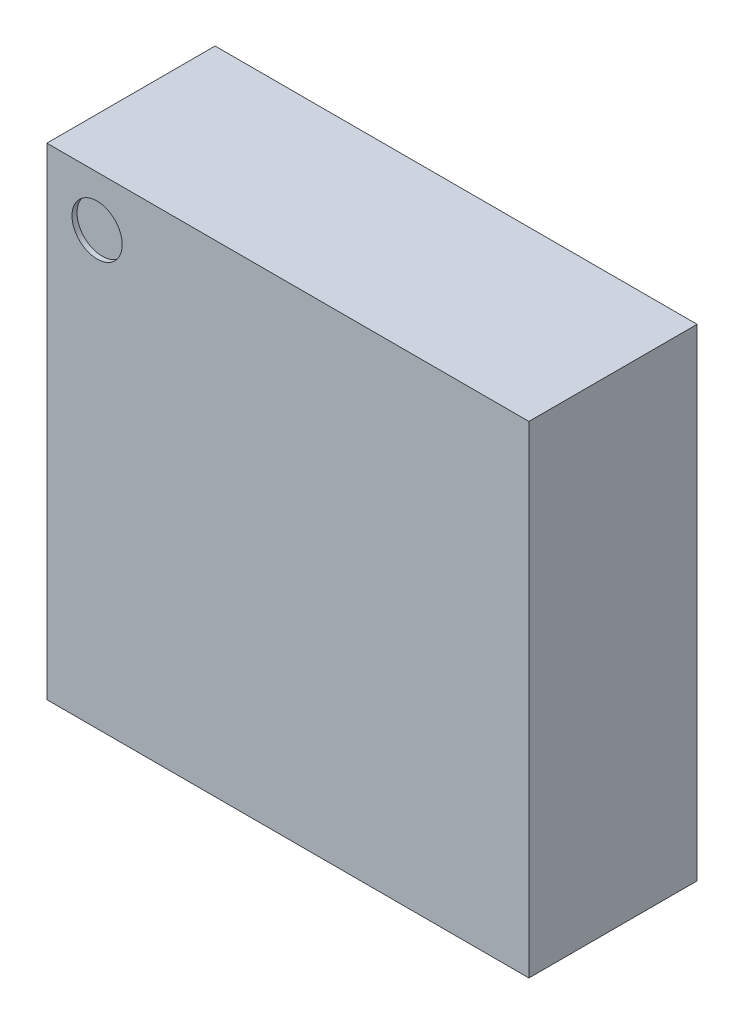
ISO-10303-21;
HEADER;
FILE_DESCRIPTION(('STEP AP214'),'2;1');
FILE_NAME('part.step','',(''),(''),'','','');
FILE_SCHEMA(('AUTOMOTIVE_DESIGN { 1 0 10303 214 1 1 1 1 }'));
ENDSEC;
DATA;
#1=APPLICATION_CONTEXT('core data for automotive mechanical design processes');
#2=APPLICATION_PROTOCOL_DEFINITION('international standard','automotive_design',2000,#1);
#3=PRODUCT_CONTEXT('',#1,'mechanical');
#4=PRODUCT('Part','Part','',(#3));
#5=PRODUCT_RELATED_PRODUCT_CATEGORY('part','',(#4));
#6=PRODUCT_DEFINITION_FORMATION('','',#4);
#7=PRODUCT_DEFINITION_CONTEXT('part definition',#1,'design');
#8=PRODUCT_DEFINITION('design','',#6,#7);
#9=PRODUCT_DEFINITION_SHAPE('','',#8);
#10=(LENGTH_UNIT() NAMED_UNIT(*) SI_UNIT(.MILLI.,.METRE.));
#11=(NAMED_UNIT(*) PLANE_ANGLE_UNIT() SI_UNIT($,.RADIAN.));
#12=(NAMED_UNIT(*) SI_UNIT($,.STERADIAN.) SOLID_ANGLE_UNIT());
#13=UNCERTAINTY_MEASURE_WITH_UNIT(LENGTH_MEASURE(1.E-05),#10,'distance_accuracy_value','');
#14=(GEOMETRIC_REPRESENTATION_CONTEXT(3) GLOBAL_UNCERTAINTY_ASSIGNED_CONTEXT((#13)) GLOBAL_UNIT_ASSIGNED_CONTEXT((#10,
#11,#12)) REPRESENTATION_CONTEXT('',''));
#15=CARTESIAN_POINT('',(0.,0.,0.));
#16=DIRECTION('',(0.,0.,1.));
#17=DIRECTION('',(1.,0.,0.));
#18=AXIS2_PLACEMENT_3D('',#15,#16,#17);
#19=CARTESIAN_POINT('',(0.,-0.48000000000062,0.512499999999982));
#20=DIRECTION('',(0.,0.,1.));
#21=DIRECTION('',(1.,0.,0.));
#22=AXIS2_PLACEMENT_3D('',#19,#20,#21);
#23=PLANE('',#22);
#24=CARTESIAN_POINT('',(-0.380000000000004,0.380000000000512,0.512499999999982));
#25=DIRECTION('',(0.,0.,1.));
#26=DIRECTION('',(1.,0.,0.));
#27=AXIS2_PLACEMENT_3D('',#24,#25,#26);
#28=CIRCLE('',#27,0.0500000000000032);
#29=CARTESIAN_POINT('',(-0.330000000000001,0.380000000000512,0.512499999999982));
#30=VERTEX_POINT('',#29);
#31=EDGE_CURVE('E19',#30,#30,#28,.T.);
#32=ORIENTED_EDGE('',*,*,#31,.T.);
#33=EDGE_LOOP('',(#32));
#34=FACE_BOUND('',#33,.T.);
#35=ADVANCED_FACE('F16',(#34),#23,.T.);
#36=CARTESIAN_POINT('',(-0.380000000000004,0.380000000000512,0.522499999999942));
#37=DIRECTION('',(0.,0.,1.));
#38=DIRECTION('',(1.,0.,0.));
#39=AXIS2_PLACEMENT_3D('',#36,#37,#38);
#40=CYLINDRICAL_SURFACE('',#39,0.0500000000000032);
#41=ORIENTED_EDGE('',*,*,#31,.F.);
#42=EDGE_LOOP('',(#41));
#43=FACE_BOUND('',#42,.T.);
#44=CARTESIAN_POINT('',(-0.380000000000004,0.380000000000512,0.522499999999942));
#45=DIRECTION('',(0.,0.,1.));
#46=DIRECTION('',(1.,0.,0.));
#47=AXIS2_PLACEMENT_3D('',#44,#45,#46);
#48=CIRCLE('',#47,0.0500000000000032);
#49=CARTESIAN_POINT('',(-0.330000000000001,0.380000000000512,0.522499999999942));
#50=VERTEX_POINT('',#49);
#51=EDGE_CURVE('E68',#50,#50,#48,.F.);
#52=ORIENTED_EDGE('',*,*,#51,.F.);
#53=EDGE_LOOP('',(#52));
#54=FACE_BOUND('',#53,.T.);
#55=ADVANCED_FACE('F88',(#43,#54),#40,.F.);
#56=CARTESIAN_POINT('',(-0.480000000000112,-0.48000000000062,0.522499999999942));
#57=DIRECTION('',(0.,0.,1.));
#58=DIRECTION('',(1.,0.,0.));
#59=AXIS2_PLACEMENT_3D('',#56,#57,#58);
#60=PLANE('',#59);
#61=ORIENTED_EDGE('',*,*,#51,.T.);
#62=EDGE_LOOP('',(#61));
#63=FACE_BOUND('',#62,.T.);
#64=DIRECTION('',(0.,1.,0.));
#65=VECTOR('',#64,1.);
#66=CARTESIAN_POINT('',(-0.480000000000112,-0.48000000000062,0.522499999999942));
#67=LINE('',#66,#65);
#68=CARTESIAN_POINT('',(-0.480000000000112,-0.48000000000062,0.522499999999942));
#69=VERTEX_POINT('',#68);
#70=CARTESIAN_POINT('',(-0.480000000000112,0.48000000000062,0.522499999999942));
#71=VERTEX_POINT('',#70);
#72=EDGE_CURVE('E59',#69,#71,#67,.T.);
#73=ORIENTED_EDGE('',*,*,#72,.F.);
#74=DIRECTION('',(1.,0.,0.));
#75=VECTOR('',#74,1.);
#76=CARTESIAN_POINT('',(0.,-0.48000000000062,0.522499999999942));
#77=LINE('',#76,#75);
#78=CARTESIAN_POINT('',(0.480000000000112,-0.48000000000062,0.522499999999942));
#79=VERTEX_POINT('',#78);
#80=EDGE_CURVE('E197',#69,#79,#77,.T.);
#81=ORIENTED_EDGE('',*,*,#80,.T.);
#82=DIRECTION('',(0.,1.,0.));
#83=VECTOR('',#82,1.);
#84=CARTESIAN_POINT('',(0.480000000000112,-0.48000000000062,0.522499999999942));
#85=LINE('',#84,#83);
#86=CARTESIAN_POINT('',(0.480000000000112,0.48000000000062,0.522499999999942));
#87=VERTEX_POINT('',#86);
#88=EDGE_CURVE('E71',#87,#79,#85,.F.);
#89=ORIENTED_EDGE('',*,*,#88,.F.);
#90=DIRECTION('',(1.,0.,0.));
#91=VECTOR('',#90,1.);
#92=CARTESIAN_POINT('',(0.,0.48000000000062,0.522499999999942));
#93=LINE('',#92,#91);
#94=EDGE_CURVE('E54',#71,#87,#93,.T.);
#95=ORIENTED_EDGE('',*,*,#94,.F.);
#96=EDGE_LOOP('',(#73,#81,#89,#95));
#97=FACE_BOUND('',#96,.T.);
#98=ADVANCED_FACE('F70',(#63,#97),#60,.T.);
#99=CARTESIAN_POINT('',(-0.480000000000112,-0.48000000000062,0.187500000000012));
#100=DIRECTION('',(-1.,0.,0.));
#101=DIRECTION('',(0.,0.,1.));
#102=AXIS2_PLACEMENT_3D('',#99,#100,#101);
#103=PLANE('',#102);
#104=DIRECTION('',(0.,1.,0.));
#105=VECTOR('',#104,1.);
#106=CARTESIAN_POINT('',(-0.480000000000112,-0.48000000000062,0.187500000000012));
#107=LINE('',#106,#105);
#108=CARTESIAN_POINT('',(-0.480000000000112,-0.48000000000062,0.187500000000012));
#109=VERTEX_POINT('',#108);
#110=CARTESIAN_POINT('',(-0.480000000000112,0.48000000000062,0.187500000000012));
#111=VERTEX_POINT('',#110);
#112=EDGE_CURVE('E198',#109,#111,#107,.T.);
#113=ORIENTED_EDGE('',*,*,#112,.F.);
#114=DIRECTION('',(0.,0.,1.));
#115=VECTOR('',#114,1.);
#116=CARTESIAN_POINT('',(-0.480000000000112,-0.48000000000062,0.));
#117=LINE('',#116,#115);
#118=EDGE_CURVE('E64',#109,#69,#117,.T.);
#119=ORIENTED_EDGE('',*,*,#118,.T.);
#120=ORIENTED_EDGE('',*,*,#72,.T.);
#121=DIRECTION('',(0.,0.,1.));
#122=VECTOR('',#121,1.);
#123=CARTESIAN_POINT('',(-0.480000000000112,0.48000000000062,0.));
#124=LINE('',#123,#122);
#125=EDGE_CURVE('E61',#111,#71,#124,.T.);
#126=ORIENTED_EDGE('',*,*,#125,.F.);
#127=EDGE_LOOP('',(#113,#119,#120,#126));
#128=FACE_BOUND('',#127,.T.);
#129=ADVANCED_FACE('F60',(#128),#103,.T.);
#130=CARTESIAN_POINT('',(0.,0.48000000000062,0.));
#131=DIRECTION('',(0.,1.,0.));
#132=DIRECTION('',(0.,0.,1.));
#133=AXIS2_PLACEMENT_3D('',#130,#131,#132);
#134=PLANE('',#133);
#135=ORIENTED_EDGE('',*,*,#94,.T.);
#136=DIRECTION('',(0.,0.,-1.));
#137=VECTOR('',#136,1.);
#138=CARTESIAN_POINT('',(0.480000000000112,0.48000000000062,0.522499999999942));
#139=LINE('',#138,#137);
#140=CARTESIAN_POINT('',(0.480000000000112,0.48000000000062,0.187500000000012));
#141=VERTEX_POINT('',#140);
#142=EDGE_CURVE('E73',#141,#87,#139,.F.);
#143=ORIENTED_EDGE('',*,*,#142,.F.);
#144=DIRECTION('',(-1.,0.,0.));
#145=VECTOR('',#144,1.);
#146=CARTESIAN_POINT('',(0.480000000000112,0.48000000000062,0.187500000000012));
#147=LINE('',#146,#145);
#148=EDGE_CURVE('E77',#111,#141,#147,.F.);
#149=ORIENTED_EDGE('',*,*,#148,.F.);
#150=ORIENTED_EDGE('',*,*,#125,.T.);
#151=EDGE_LOOP('',(#135,#143,#149,#150));
#152=FACE_BOUND('',#151,.T.);
#153=ADVANCED_FACE('F75',(#152),#134,.T.);
#154=CARTESIAN_POINT('',(0.480000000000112,-0.48000000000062,0.522499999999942));
#155=DIRECTION('',(1.,0.,0.));
#156=DIRECTION('',(0.,0.,-1.));
#157=AXIS2_PLACEMENT_3D('',#154,#155,#156);
#158=PLANE('',#157);
#159=ORIENTED_EDGE('',*,*,#88,.T.);
#160=DIRECTION('',(0.,0.,1.));
#161=VECTOR('',#160,1.);
#162=CARTESIAN_POINT('',(0.480000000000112,-0.48000000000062,0.));
#163=LINE('',#162,#161);
#164=CARTESIAN_POINT('',(0.480000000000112,-0.48000000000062,0.187500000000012));
#165=VERTEX_POINT('',#164);
#166=EDGE_CURVE('E34',#79,#165,#163,.F.);
#167=ORIENTED_EDGE('',*,*,#166,.T.);
#168=DIRECTION('',(0.,1.,0.));
#169=VECTOR('',#168,1.);
#170=CARTESIAN_POINT('',(0.480000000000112,-0.48000000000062,0.187500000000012));
#171=LINE('',#170,#169);
#172=EDGE_CURVE('E25',#141,#165,#171,.F.);
#173=ORIENTED_EDGE('',*,*,#172,.F.);
#174=ORIENTED_EDGE('',*,*,#142,.T.);
#175=EDGE_LOOP('',(#159,#167,#173,#174));
#176=FACE_BOUND('',#175,.T.);
#177=ADVANCED_FACE('F105',(#176),#158,.T.);
#178=CARTESIAN_POINT('',(0.,-0.48000000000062,0.));
#179=DIRECTION('',(0.,1.,0.));
#180=DIRECTION('',(0.,0.,1.));
#181=AXIS2_PLACEMENT_3D('',#178,#179,#180);
#182=PLANE('',#181);
#183=ORIENTED_EDGE('',*,*,#118,.F.);
#184=DIRECTION('',(-1.,0.,0.));
#185=VECTOR('',#184,1.);
#186=CARTESIAN_POINT('',(0.480000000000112,-0.48000000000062,0.187500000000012));
#187=LINE('',#186,#185);
#188=EDGE_CURVE('E11',#165,#109,#187,.T.);
#189=ORIENTED_EDGE('',*,*,#188,.F.);
#190=ORIENTED_EDGE('',*,*,#166,.F.);
#191=ORIENTED_EDGE('',*,*,#80,.F.);
#192=EDGE_LOOP('',(#183,#189,#190,#191));
#193=FACE_BOUND('',#192,.T.);
#194=ADVANCED_FACE('F99',(#193),#182,.F.);
#195=CARTESIAN_POINT('',(0.480000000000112,-0.48000000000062,0.187500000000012));
#196=DIRECTION('',(0.,0.,-1.));
#197=DIRECTION('',(-1.,0.,0.));
#198=AXIS2_PLACEMENT_3D('',#195,#196,#197);
#199=PLANE('',#198);
#200=ORIENTED_EDGE('',*,*,#172,.T.);
#201=ORIENTED_EDGE('',*,*,#188,.T.);
#202=ORIENTED_EDGE('',*,*,#112,.T.);
#203=ORIENTED_EDGE('',*,*,#148,.T.);
#204=EDGE_LOOP('',(#200,#201,#202,#203));
#205=FACE_BOUND('',#204,.T.);
#206=ADVANCED_FACE('F97',(#205),#199,.T.);
#207=CLOSED_SHELL('',(#35,#55,#98,#129,#153,#177,#194,#206));
#208=MANIFOLD_SOLID_BREP('B1',#207);
#209=ADVANCED_BREP_SHAPE_REPRESENTATION('',(#18,#208),#14);
#210=SHAPE_DEFINITION_REPRESENTATION(#9,#209);
ENDSEC;
END-ISO-10303-21;
